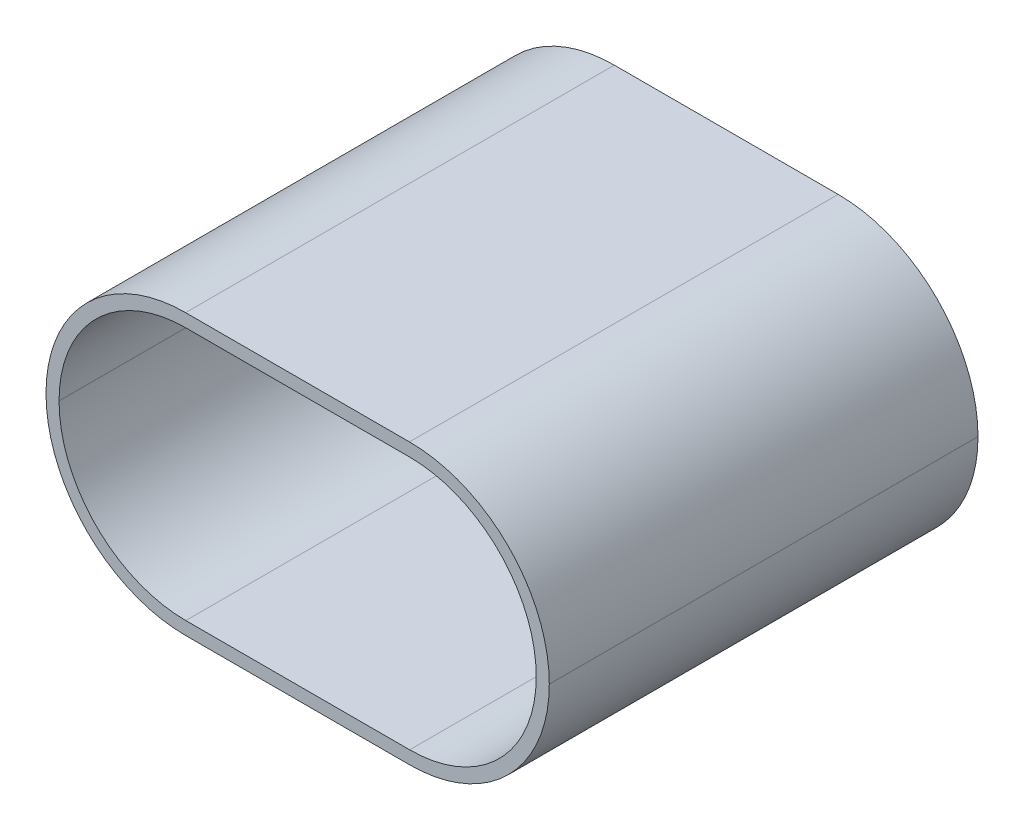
ISO-10303-21;
HEADER;
FILE_DESCRIPTION(('STEP AP214'),'2;1');
FILE_NAME('part.step','',(''),(''),'','','');
FILE_SCHEMA(('AUTOMOTIVE_DESIGN { 1 0 10303 214 1 1 1 1 }'));
ENDSEC;
DATA;
#1=APPLICATION_CONTEXT('core data for automotive mechanical design processes');
#2=APPLICATION_PROTOCOL_DEFINITION('international standard','automotive_design',2000,#1);
#3=PRODUCT_CONTEXT('',#1,'mechanical');
#4=PRODUCT('Part','Part','',(#3));
#5=PRODUCT_RELATED_PRODUCT_CATEGORY('part','',(#4));
#6=PRODUCT_DEFINITION_FORMATION('','',#4);
#7=PRODUCT_DEFINITION_CONTEXT('part definition',#1,'design');
#8=PRODUCT_DEFINITION('design','',#6,#7);
#9=PRODUCT_DEFINITION_SHAPE('','',#8);
#10=(LENGTH_UNIT() NAMED_UNIT(*) SI_UNIT(.MILLI.,.METRE.));
#11=(NAMED_UNIT(*) PLANE_ANGLE_UNIT() SI_UNIT($,.RADIAN.));
#12=(NAMED_UNIT(*) SI_UNIT($,.STERADIAN.) SOLID_ANGLE_UNIT());
#13=UNCERTAINTY_MEASURE_WITH_UNIT(LENGTH_MEASURE(1.E-05),#10,'distance_accuracy_value','');
#14=(GEOMETRIC_REPRESENTATION_CONTEXT(3) GLOBAL_UNCERTAINTY_ASSIGNED_CONTEXT((#13)) GLOBAL_UNIT_ASSIGNED_CONTEXT((#10,
#11,#12)) REPRESENTATION_CONTEXT('',''));
#15=CARTESIAN_POINT('',(0.,0.,0.));
#16=DIRECTION('',(0.,0.,1.));
#17=DIRECTION('',(1.,0.,0.));
#18=AXIS2_PLACEMENT_3D('',#15,#16,#17);
#19=CARTESIAN_POINT('',(3.17090192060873,-14.1,-24.));
#20=DIRECTION('',(0.,0.,1.));
#21=DIRECTION('',(1.,0.,0.));
#22=AXIS2_PLACEMENT_3D('',#19,#20,#21);
#23=CYLINDRICAL_SURFACE('',#22,6.8);
#24=CARTESIAN_POINT('',(3.17090192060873,-14.1,-23.));
#25=DIRECTION('',(0.,0.,-1.));
#26=DIRECTION('',(-1.,0.,0.));
#27=AXIS2_PLACEMENT_3D('',#24,#25,#26);
#28=CIRCLE('',#27,6.8);
#29=CARTESIAN_POINT('',(9.97090192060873,-14.1,-23.));
#30=VERTEX_POINT('',#29);
#31=CARTESIAN_POINT('',(3.17090192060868,-7.3,-23.));
#32=VERTEX_POINT('',#31);
#33=EDGE_CURVE('E47',#30,#32,#28,.F.);
#34=ORIENTED_EDGE('',*,*,#33,.F.);
#35=DIRECTION('',(0.,0.,1.));
#36=VECTOR('',#35,1.);
#37=CARTESIAN_POINT('',(9.97090192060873,-14.1,-24.));
#38=LINE('',#37,#36);
#39=CARTESIAN_POINT('',(9.97090192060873,-14.1,-1.));
#40=VERTEX_POINT('',#39);
#41=EDGE_CURVE('E332',#30,#40,#38,.T.);
#42=ORIENTED_EDGE('',*,*,#41,.T.);
#43=CARTESIAN_POINT('',(3.17090192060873,-14.1,-1.));
#44=DIRECTION('',(0.,0.,1.));
#45=DIRECTION('',(1.,0.,0.));
#46=AXIS2_PLACEMENT_3D('',#43,#44,#45);
#47=CIRCLE('',#46,6.8);
#48=CARTESIAN_POINT('',(3.17090192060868,-7.3,-1.));
#49=VERTEX_POINT('',#48);
#50=EDGE_CURVE('E328',#49,#40,#47,.F.);
#51=ORIENTED_EDGE('',*,*,#50,.F.);
#52=DIRECTION('',(0.,0.,1.));
#53=VECTOR('',#52,1.);
#54=CARTESIAN_POINT('',(3.17090192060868,-7.3,-24.));
#55=LINE('',#54,#53);
#56=EDGE_CURVE('E331',#32,#49,#55,.T.);
#57=ORIENTED_EDGE('',*,*,#56,.F.);
#58=EDGE_LOOP('',(#34,#42,#51,#57));
#59=FACE_BOUND('',#58,.T.);
#60=ADVANCED_FACE('F32',(#59),#23,.F.);
#61=CARTESIAN_POINT('',(9.97090192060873,-14.11,-24.));
#62=DIRECTION('',(1.,-1.73472347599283E-13,0.));
#63=DIRECTION('',(1.73472347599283E-13,1.,0.));
#64=AXIS2_PLACEMENT_3D('',#61,#62,#63);
#65=PLANE('',#64);
#66=DIRECTION('',(1.73472347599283E-13,1.,0.));
#67=VECTOR('',#66,1.);
#68=CARTESIAN_POINT('',(9.97090192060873,-14.11,-23.));
#69=LINE('',#68,#67);
#70=CARTESIAN_POINT('',(9.97090192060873,-14.11,-23.));
#71=VERTEX_POINT('',#70);
#72=EDGE_CURVE('E54',#71,#30,#69,.T.);
#73=ORIENTED_EDGE('',*,*,#72,.F.);
#74=DIRECTION('',(0.,0.,1.));
#75=VECTOR('',#74,1.);
#76=CARTESIAN_POINT('',(9.97090192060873,-14.11,-24.));
#77=LINE('',#76,#75);
#78=CARTESIAN_POINT('',(9.97090192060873,-14.11,-1.));
#79=VERTEX_POINT('',#78);
#80=EDGE_CURVE('E335',#71,#79,#77,.T.);
#81=ORIENTED_EDGE('',*,*,#80,.T.);
#82=DIRECTION('',(-1.73472347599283E-13,-1.,0.));
#83=VECTOR('',#82,1.);
#84=CARTESIAN_POINT('',(9.97090192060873,-14.11,-1.));
#85=LINE('',#84,#83);
#86=EDGE_CURVE('E325',#40,#79,#85,.T.);
#87=ORIENTED_EDGE('',*,*,#86,.F.);
#88=ORIENTED_EDGE('',*,*,#41,.F.);
#89=EDGE_LOOP('',(#73,#81,#87,#88));
#90=FACE_BOUND('',#89,.T.);
#91=ADVANCED_FACE('F394',(#90),#65,.F.);
#92=CARTESIAN_POINT('',(3.18090192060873,-14.11,-24.));
#93=DIRECTION('',(0.,0.,1.));
#94=DIRECTION('',(1.,0.,0.));
#95=AXIS2_PLACEMENT_3D('',#92,#93,#94);
#96=CYLINDRICAL_SURFACE('',#95,6.79);
#97=CARTESIAN_POINT('',(3.18090192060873,-14.11,-23.));
#98=DIRECTION('',(0.,0.,-1.));
#99=DIRECTION('',(-1.,0.,0.));
#100=AXIS2_PLACEMENT_3D('',#97,#98,#99);
#101=CIRCLE('',#100,6.79);
#102=CARTESIAN_POINT('',(3.18090192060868,-20.9,-23.));
#103=VERTEX_POINT('',#102);
#104=EDGE_CURVE('E281',#103,#71,#101,.F.);
#105=ORIENTED_EDGE('',*,*,#104,.F.);
#106=DIRECTION('',(0.,0.,1.));
#107=VECTOR('',#106,1.);
#108=CARTESIAN_POINT('',(3.18090192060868,-20.9,-24.));
#109=LINE('',#108,#107);
#110=CARTESIAN_POINT('',(3.18090192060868,-20.9,-1.));
#111=VERTEX_POINT('',#110);
#112=EDGE_CURVE('E337',#103,#111,#109,.T.);
#113=ORIENTED_EDGE('',*,*,#112,.T.);
#114=CARTESIAN_POINT('',(3.18090192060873,-14.11,-1.));
#115=DIRECTION('',(0.,0.,1.));
#116=DIRECTION('',(1.,0.,0.));
#117=AXIS2_PLACEMENT_3D('',#114,#115,#116);
#118=CIRCLE('',#117,6.79);
#119=EDGE_CURVE('E322',#79,#111,#118,.F.);
#120=ORIENTED_EDGE('',*,*,#119,.F.);
#121=ORIENTED_EDGE('',*,*,#80,.F.);
#122=EDGE_LOOP('',(#105,#113,#120,#121));
#123=FACE_BOUND('',#122,.T.);
#124=ADVANCED_FACE('F397',(#123),#96,.F.);
#125=CARTESIAN_POINT('',(-8.82909807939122,-20.9,-24.));
#126=DIRECTION('',(0.,-1.,0.));
#127=DIRECTION('',(0.,0.,-1.));
#128=AXIS2_PLACEMENT_3D('',#125,#126,#127);
#129=PLANE('',#128);
#130=DIRECTION('',(1.,0.,0.));
#131=VECTOR('',#130,1.);
#132=CARTESIAN_POINT('',(-8.82909807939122,-20.9,-23.));
#133=LINE('',#132,#131);
#134=CARTESIAN_POINT('',(-8.82909807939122,-20.9,-23.));
#135=VERTEX_POINT('',#134);
#136=EDGE_CURVE('E278',#135,#103,#133,.T.);
#137=ORIENTED_EDGE('',*,*,#136,.F.);
#138=DIRECTION('',(0.,0.,1.));
#139=VECTOR('',#138,1.);
#140=CARTESIAN_POINT('',(-8.82909807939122,-20.9,-24.));
#141=LINE('',#140,#139);
#142=CARTESIAN_POINT('',(-8.82909807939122,-20.9,-1.));
#143=VERTEX_POINT('',#142);
#144=EDGE_CURVE('E339',#135,#143,#141,.T.);
#145=ORIENTED_EDGE('',*,*,#144,.T.);
#146=DIRECTION('',(-1.,0.,0.));
#147=VECTOR('',#146,1.);
#148=CARTESIAN_POINT('',(-8.82909807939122,-20.9,-1.));
#149=LINE('',#148,#147);
#150=EDGE_CURVE('E319',#111,#143,#149,.T.);
#151=ORIENTED_EDGE('',*,*,#150,.F.);
#152=ORIENTED_EDGE('',*,*,#112,.F.);
#153=EDGE_LOOP('',(#137,#145,#151,#152));
#154=FACE_BOUND('',#153,.T.);
#155=ADVANCED_FACE('F401',(#154),#129,.F.);
#156=CARTESIAN_POINT('',(-8.82909807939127,-14.1,-24.));
#157=DIRECTION('',(0.,0.,1.));
#158=DIRECTION('',(1.,0.,0.));
#159=AXIS2_PLACEMENT_3D('',#156,#157,#158);
#160=CYLINDRICAL_SURFACE('',#159,6.8);
#161=CARTESIAN_POINT('',(-8.82909807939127,-14.1,-23.));
#162=DIRECTION('',(0.,0.,-1.));
#163=DIRECTION('',(-1.,0.,0.));
#164=AXIS2_PLACEMENT_3D('',#161,#162,#163);
#165=CIRCLE('',#164,6.8);
#166=CARTESIAN_POINT('',(-15.6290980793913,-14.1,-23.));
#167=VERTEX_POINT('',#166);
#168=EDGE_CURVE('E275',#167,#135,#165,.F.);
#169=ORIENTED_EDGE('',*,*,#168,.F.);
#170=DIRECTION('',(0.,0.,1.));
#171=VECTOR('',#170,1.);
#172=CARTESIAN_POINT('',(-15.6290980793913,-14.1,-24.));
#173=LINE('',#172,#171);
#174=CARTESIAN_POINT('',(-15.6290980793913,-14.1,-1.));
#175=VERTEX_POINT('',#174);
#176=EDGE_CURVE('E341',#167,#175,#173,.T.);
#177=ORIENTED_EDGE('',*,*,#176,.T.);
#178=CARTESIAN_POINT('',(-8.82909807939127,-14.1,-1.));
#179=DIRECTION('',(0.,0.,1.));
#180=DIRECTION('',(1.,0.,0.));
#181=AXIS2_PLACEMENT_3D('',#178,#179,#180);
#182=CIRCLE('',#181,6.8);
#183=EDGE_CURVE('E316',#143,#175,#182,.F.);
#184=ORIENTED_EDGE('',*,*,#183,.F.);
#185=ORIENTED_EDGE('',*,*,#144,.F.);
#186=EDGE_LOOP('',(#169,#177,#184,#185));
#187=FACE_BOUND('',#186,.T.);
#188=ADVANCED_FACE('F406',(#187),#160,.F.);
#189=CARTESIAN_POINT('',(-15.6290980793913,-14.09,-24.));
#190=DIRECTION('',(-1.,0.,0.));
#191=DIRECTION('',(0.,0.,1.));
#192=AXIS2_PLACEMENT_3D('',#189,#190,#191);
#193=PLANE('',#192);
#194=DIRECTION('',(0.,-1.,0.));
#195=VECTOR('',#194,1.);
#196=CARTESIAN_POINT('',(-15.6290980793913,-14.09,-23.));
#197=LINE('',#196,#195);
#198=CARTESIAN_POINT('',(-15.6290980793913,-14.09,-23.));
#199=VERTEX_POINT('',#198);
#200=EDGE_CURVE('E272',#199,#167,#197,.T.);
#201=ORIENTED_EDGE('',*,*,#200,.F.);
#202=DIRECTION('',(0.,0.,1.));
#203=VECTOR('',#202,1.);
#204=CARTESIAN_POINT('',(-15.6290980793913,-14.09,-24.));
#205=LINE('',#204,#203);
#206=CARTESIAN_POINT('',(-15.6290980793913,-14.09,-1.));
#207=VERTEX_POINT('',#206);
#208=EDGE_CURVE('E343',#199,#207,#205,.T.);
#209=ORIENTED_EDGE('',*,*,#208,.T.);
#210=DIRECTION('',(0.,1.,0.));
#211=VECTOR('',#210,1.);
#212=CARTESIAN_POINT('',(-15.6290980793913,-14.09,-1.));
#213=LINE('',#212,#211);
#214=EDGE_CURVE('E313',#175,#207,#213,.T.);
#215=ORIENTED_EDGE('',*,*,#214,.F.);
#216=ORIENTED_EDGE('',*,*,#176,.F.);
#217=EDGE_LOOP('',(#201,#209,#215,#216));
#218=FACE_BOUND('',#217,.T.);
#219=ADVANCED_FACE('F409',(#218),#193,.F.);
#220=CARTESIAN_POINT('',(-8.83909807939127,-14.09,-24.));
#221=DIRECTION('',(0.,0.,1.));
#222=DIRECTION('',(1.,0.,0.));
#223=AXIS2_PLACEMENT_3D('',#220,#221,#222);
#224=CYLINDRICAL_SURFACE('',#223,6.79);
#225=CARTESIAN_POINT('',(-8.83909807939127,-14.09,-23.));
#226=DIRECTION('',(0.,0.,-1.));
#227=DIRECTION('',(-1.,0.,0.));
#228=AXIS2_PLACEMENT_3D('',#225,#226,#227);
#229=CIRCLE('',#228,6.79);
#230=CARTESIAN_POINT('',(-8.83909807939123,-7.3,-23.));
#231=VERTEX_POINT('',#230);
#232=EDGE_CURVE('E258',#231,#199,#229,.F.);
#233=ORIENTED_EDGE('',*,*,#232,.F.);
#234=DIRECTION('',(0.,0.,1.));
#235=VECTOR('',#234,1.);
#236=CARTESIAN_POINT('',(-8.83909807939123,-7.3,-24.));
#237=LINE('',#236,#235);
#238=CARTESIAN_POINT('',(-8.83909807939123,-7.3,-1.));
#239=VERTEX_POINT('',#238);
#240=EDGE_CURVE('E345',#231,#239,#237,.T.);
#241=ORIENTED_EDGE('',*,*,#240,.T.);
#242=CARTESIAN_POINT('',(-8.83909807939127,-14.09,-1.));
#243=DIRECTION('',(0.,0.,1.));
#244=DIRECTION('',(1.,0.,0.));
#245=AXIS2_PLACEMENT_3D('',#242,#243,#244);
#246=CIRCLE('',#245,6.79);
#247=EDGE_CURVE('E310',#207,#239,#246,.F.);
#248=ORIENTED_EDGE('',*,*,#247,.F.);
#249=ORIENTED_EDGE('',*,*,#208,.F.);
#250=EDGE_LOOP('',(#233,#241,#248,#249));
#251=FACE_BOUND('',#250,.T.);
#252=ADVANCED_FACE('F413',(#251),#224,.F.);
#253=CARTESIAN_POINT('',(3.17090192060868,-7.3,-24.));
#254=DIRECTION('',(0.,1.,0.));
#255=DIRECTION('',(0.,0.,1.));
#256=AXIS2_PLACEMENT_3D('',#253,#254,#255);
#257=PLANE('',#256);
#258=DIRECTION('',(-1.,0.,0.));
#259=VECTOR('',#258,1.);
#260=CARTESIAN_POINT('',(3.17090192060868,-7.3,-23.));
#261=LINE('',#260,#259);
#262=EDGE_CURVE('E11',#32,#231,#261,.T.);
#263=ORIENTED_EDGE('',*,*,#262,.F.);
#264=ORIENTED_EDGE('',*,*,#56,.T.);
#265=DIRECTION('',(1.,0.,0.));
#266=VECTOR('',#265,1.);
#267=CARTESIAN_POINT('',(3.17090192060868,-7.3,-1.));
#268=LINE('',#267,#266);
#269=EDGE_CURVE('E40',#239,#49,#268,.T.);
#270=ORIENTED_EDGE('',*,*,#269,.F.);
#271=ORIENTED_EDGE('',*,*,#240,.F.);
#272=EDGE_LOOP('',(#263,#264,#270,#271));
#273=FACE_BOUND('',#272,.T.);
#274=ADVANCED_FACE('F414',(#273),#257,.F.);
#275=CARTESIAN_POINT('',(-8.82909807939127,-14.1,-24.));
#276=DIRECTION('',(0.,0.,1.));
#277=DIRECTION('',(1.,0.,0.));
#278=AXIS2_PLACEMENT_3D('',#275,#276,#277);
#279=CYLINDRICAL_SURFACE('',#278,7.5);
#280=DIRECTION('',(0.,0.,1.));
#281=VECTOR('',#280,1.);
#282=CARTESIAN_POINT('',(-8.82909807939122,-21.6,-24.));
#283=LINE('',#282,#281);
#284=CARTESIAN_POINT('',(-8.82909807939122,-21.6,-24.));
#285=VERTEX_POINT('',#284);
#286=CARTESIAN_POINT('',(-8.82909807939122,-21.6,-1.));
#287=VERTEX_POINT('',#286);
#288=EDGE_CURVE('E371',#285,#287,#283,.T.);
#289=ORIENTED_EDGE('',*,*,#288,.T.);
#290=CARTESIAN_POINT('',(-8.82909807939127,-14.1,-1.));
#291=DIRECTION('',(0.,0.,1.));
#292=DIRECTION('',(1.,0.,0.));
#293=AXIS2_PLACEMENT_3D('',#290,#291,#292);
#294=CIRCLE('',#293,7.5);
#295=CARTESIAN_POINT('',(-16.3290980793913,-14.1,-1.));
#296=VERTEX_POINT('',#295);
#297=EDGE_CURVE('E286',#296,#287,#294,.T.);
#298=ORIENTED_EDGE('',*,*,#297,.F.);
#299=DIRECTION('',(0.,0.,1.));
#300=VECTOR('',#299,1.);
#301=CARTESIAN_POINT('',(-16.3290980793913,-14.1,-24.));
#302=LINE('',#301,#300);
#303=CARTESIAN_POINT('',(-16.3290980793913,-14.1,-24.));
#304=VERTEX_POINT('',#303);
#305=EDGE_CURVE('E372',#304,#296,#302,.T.);
#306=ORIENTED_EDGE('',*,*,#305,.F.);
#307=CARTESIAN_POINT('',(-8.82909807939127,-14.1,-24.));
#308=DIRECTION('',(0.,0.,1.));
#309=DIRECTION('',(1.,0.,0.));
#310=AXIS2_PLACEMENT_3D('',#307,#308,#309);
#311=CIRCLE('',#310,7.5);
#312=EDGE_CURVE('E334',#304,#285,#311,.T.);
#313=ORIENTED_EDGE('',*,*,#312,.T.);
#314=EDGE_LOOP('',(#289,#298,#306,#313));
#315=FACE_BOUND('',#314,.T.);
#316=ADVANCED_FACE('F34',(#315),#279,.T.);
#317=CARTESIAN_POINT('',(-16.3290980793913,-14.09,-24.));
#318=DIRECTION('',(-1.,0.,0.));
#319=DIRECTION('',(0.,0.,1.));
#320=AXIS2_PLACEMENT_3D('',#317,#318,#319);
#321=PLANE('',#320);
#322=ORIENTED_EDGE('',*,*,#305,.T.);
#323=DIRECTION('',(0.,-1.,0.));
#324=VECTOR('',#323,1.);
#325=CARTESIAN_POINT('',(-16.3290980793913,-14.09,-1.));
#326=LINE('',#325,#324);
#327=CARTESIAN_POINT('',(-16.3290980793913,-14.09,-1.));
#328=VERTEX_POINT('',#327);
#329=EDGE_CURVE('E307',#328,#296,#326,.T.);
#330=ORIENTED_EDGE('',*,*,#329,.F.);
#331=DIRECTION('',(0.,0.,1.));
#332=VECTOR('',#331,1.);
#333=CARTESIAN_POINT('',(-16.3290980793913,-14.09,-24.));
#334=LINE('',#333,#332);
#335=CARTESIAN_POINT('',(-16.3290980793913,-14.09,-24.));
#336=VERTEX_POINT('',#335);
#337=EDGE_CURVE('E374',#336,#328,#334,.T.);
#338=ORIENTED_EDGE('',*,*,#337,.F.);
#339=DIRECTION('',(0.,-1.,0.));
#340=VECTOR('',#339,1.);
#341=CARTESIAN_POINT('',(-16.3290980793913,-14.09,-24.));
#342=LINE('',#341,#340);
#343=EDGE_CURVE('E368',#336,#304,#342,.T.);
#344=ORIENTED_EDGE('',*,*,#343,.T.);
#345=EDGE_LOOP('',(#322,#330,#338,#344));
#346=FACE_BOUND('',#345,.T.);
#347=ADVANCED_FACE('F421',(#346),#321,.T.);
#348=CARTESIAN_POINT('',(-8.83909807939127,-14.09,-24.));
#349=DIRECTION('',(0.,0.,1.));
#350=DIRECTION('',(1.,0.,0.));
#351=AXIS2_PLACEMENT_3D('',#348,#349,#350);
#352=CYLINDRICAL_SURFACE('',#351,7.49);
#353=ORIENTED_EDGE('',*,*,#337,.T.);
#354=CARTESIAN_POINT('',(-8.83909807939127,-14.09,-1.));
#355=DIRECTION('',(0.,0.,1.));
#356=DIRECTION('',(1.,0.,0.));
#357=AXIS2_PLACEMENT_3D('',#354,#355,#356);
#358=CIRCLE('',#357,7.49);
#359=CARTESIAN_POINT('',(-8.83909807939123,-6.6,-1.));
#360=VERTEX_POINT('',#359);
#361=EDGE_CURVE('E304',#360,#328,#358,.T.);
#362=ORIENTED_EDGE('',*,*,#361,.F.);
#363=DIRECTION('',(0.,0.,1.));
#364=VECTOR('',#363,1.);
#365=CARTESIAN_POINT('',(-8.83909807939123,-6.6,-24.));
#366=LINE('',#365,#364);
#367=CARTESIAN_POINT('',(-8.83909807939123,-6.6,-24.));
#368=VERTEX_POINT('',#367);
#369=EDGE_CURVE('E376',#368,#360,#366,.T.);
#370=ORIENTED_EDGE('',*,*,#369,.F.);
#371=CARTESIAN_POINT('',(-8.83909807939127,-14.09,-24.));
#372=DIRECTION('',(0.,0.,1.));
#373=DIRECTION('',(1.,0.,0.));
#374=AXIS2_PLACEMENT_3D('',#371,#372,#373);
#375=CIRCLE('',#374,7.49);
#376=EDGE_CURVE('E365',#368,#336,#375,.T.);
#377=ORIENTED_EDGE('',*,*,#376,.T.);
#378=EDGE_LOOP('',(#353,#362,#370,#377));
#379=FACE_BOUND('',#378,.T.);
#380=ADVANCED_FACE('F438',(#379),#352,.T.);
#381=CARTESIAN_POINT('',(3.17090192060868,-6.6,-24.));
#382=DIRECTION('',(0.,1.,0.));
#383=DIRECTION('',(0.,0.,1.));
#384=AXIS2_PLACEMENT_3D('',#381,#382,#383);
#385=PLANE('',#384);
#386=ORIENTED_EDGE('',*,*,#369,.T.);
#387=DIRECTION('',(-1.,0.,0.));
#388=VECTOR('',#387,1.);
#389=CARTESIAN_POINT('',(3.17090192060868,-6.6,-1.));
#390=LINE('',#389,#388);
#391=CARTESIAN_POINT('',(3.17090192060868,-6.6,-1.));
#392=VERTEX_POINT('',#391);
#393=EDGE_CURVE('E301',#392,#360,#390,.T.);
#394=ORIENTED_EDGE('',*,*,#393,.F.);
#395=DIRECTION('',(0.,0.,1.));
#396=VECTOR('',#395,1.);
#397=CARTESIAN_POINT('',(3.17090192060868,-6.6,-24.));
#398=LINE('',#397,#396);
#399=CARTESIAN_POINT('',(3.17090192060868,-6.6,-24.));
#400=VERTEX_POINT('',#399);
#401=EDGE_CURVE('E378',#400,#392,#398,.T.);
#402=ORIENTED_EDGE('',*,*,#401,.F.);
#403=DIRECTION('',(-1.,0.,0.));
#404=VECTOR('',#403,1.);
#405=CARTESIAN_POINT('',(3.17090192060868,-6.6,-24.));
#406=LINE('',#405,#404);
#407=EDGE_CURVE('E362',#400,#368,#406,.T.);
#408=ORIENTED_EDGE('',*,*,#407,.T.);
#409=EDGE_LOOP('',(#386,#394,#402,#408));
#410=FACE_BOUND('',#409,.T.);
#411=ADVANCED_FACE('F442',(#410),#385,.T.);
#412=CARTESIAN_POINT('',(3.17090192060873,-14.1,-24.));
#413=DIRECTION('',(0.,0.,1.));
#414=DIRECTION('',(1.,0.,0.));
#415=AXIS2_PLACEMENT_3D('',#412,#413,#414);
#416=CYLINDRICAL_SURFACE('',#415,7.5);
#417=ORIENTED_EDGE('',*,*,#401,.T.);
#418=CARTESIAN_POINT('',(3.17090192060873,-14.1,-1.));
#419=DIRECTION('',(0.,0.,1.));
#420=DIRECTION('',(1.,0.,0.));
#421=AXIS2_PLACEMENT_3D('',#418,#419,#420);
#422=CIRCLE('',#421,7.5);
#423=CARTESIAN_POINT('',(10.6709019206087,-14.1,-1.));
#424=VERTEX_POINT('',#423);
#425=EDGE_CURVE('E298',#424,#392,#422,.T.);
#426=ORIENTED_EDGE('',*,*,#425,.F.);
#427=DIRECTION('',(0.,0.,1.));
#428=VECTOR('',#427,1.);
#429=CARTESIAN_POINT('',(10.6709019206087,-14.1,-24.));
#430=LINE('',#429,#428);
#431=CARTESIAN_POINT('',(10.6709019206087,-14.1,-24.));
#432=VERTEX_POINT('',#431);
#433=EDGE_CURVE('E380',#432,#424,#430,.T.);
#434=ORIENTED_EDGE('',*,*,#433,.F.);
#435=CARTESIAN_POINT('',(3.17090192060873,-14.1,-24.));
#436=DIRECTION('',(0.,0.,1.));
#437=DIRECTION('',(1.,0.,0.));
#438=AXIS2_PLACEMENT_3D('',#435,#436,#437);
#439=CIRCLE('',#438,7.5);
#440=EDGE_CURVE('E359',#432,#400,#439,.T.);
#441=ORIENTED_EDGE('',*,*,#440,.T.);
#442=EDGE_LOOP('',(#417,#426,#434,#441));
#443=FACE_BOUND('',#442,.T.);
#444=ADVANCED_FACE('F446',(#443),#416,.T.);
#445=CARTESIAN_POINT('',(10.6709019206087,-14.1099999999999,-24.));
#446=DIRECTION('',(1.,1.73472347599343E-13,0.));
#447=DIRECTION('',(-1.73472347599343E-13,1.,0.));
#448=AXIS2_PLACEMENT_3D('',#445,#446,#447);
#449=PLANE('',#448);
#450=ORIENTED_EDGE('',*,*,#433,.T.);
#451=DIRECTION('',(-1.73472347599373E-13,1.,0.));
#452=VECTOR('',#451,1.);
#453=CARTESIAN_POINT('',(10.6709019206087,-14.1099999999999,-1.));
#454=LINE('',#453,#452);
#455=CARTESIAN_POINT('',(10.6709019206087,-14.1099999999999,-1.));
#456=VERTEX_POINT('',#455);
#457=EDGE_CURVE('E295',#456,#424,#454,.T.);
#458=ORIENTED_EDGE('',*,*,#457,.F.);
#459=DIRECTION('',(0.,0.,1.));
#460=VECTOR('',#459,1.);
#461=CARTESIAN_POINT('',(10.6709019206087,-14.1099999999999,-24.));
#462=LINE('',#461,#460);
#463=CARTESIAN_POINT('',(10.6709019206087,-14.1099999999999,-24.));
#464=VERTEX_POINT('',#463);
#465=EDGE_CURVE('E382',#464,#456,#462,.T.);
#466=ORIENTED_EDGE('',*,*,#465,.F.);
#467=DIRECTION('',(-1.73472347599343E-13,1.,0.));
#468=VECTOR('',#467,1.);
#469=CARTESIAN_POINT('',(10.6709019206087,-14.1099999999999,-24.));
#470=LINE('',#469,#468);
#471=EDGE_CURVE('E356',#464,#432,#470,.T.);
#472=ORIENTED_EDGE('',*,*,#471,.T.);
#473=EDGE_LOOP('',(#450,#458,#466,#472));
#474=FACE_BOUND('',#473,.T.);
#475=ADVANCED_FACE('F450',(#474),#449,.T.);
#476=CARTESIAN_POINT('',(3.18090192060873,-14.11,-24.));
#477=DIRECTION('',(0.,0.,1.));
#478=DIRECTION('',(1.,0.,0.));
#479=AXIS2_PLACEMENT_3D('',#476,#477,#478);
#480=CYLINDRICAL_SURFACE('',#479,7.49);
#481=ORIENTED_EDGE('',*,*,#465,.T.);
#482=CARTESIAN_POINT('',(3.18090192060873,-14.11,-1.));
#483=DIRECTION('',(0.,0.,1.));
#484=DIRECTION('',(1.,0.,0.));
#485=AXIS2_PLACEMENT_3D('',#482,#483,#484);
#486=CIRCLE('',#485,7.49);
#487=CARTESIAN_POINT('',(3.18090192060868,-21.6,-1.));
#488=VERTEX_POINT('',#487);
#489=EDGE_CURVE('E292',#488,#456,#486,.T.);
#490=ORIENTED_EDGE('',*,*,#489,.F.);
#491=DIRECTION('',(0.,0.,1.));
#492=VECTOR('',#491,1.);
#493=CARTESIAN_POINT('',(3.18090192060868,-21.6,-24.));
#494=LINE('',#493,#492);
#495=CARTESIAN_POINT('',(3.18090192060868,-21.6,-24.));
#496=VERTEX_POINT('',#495);
#497=EDGE_CURVE('E384',#496,#488,#494,.T.);
#498=ORIENTED_EDGE('',*,*,#497,.F.);
#499=CARTESIAN_POINT('',(3.18090192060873,-14.11,-24.));
#500=DIRECTION('',(0.,0.,1.));
#501=DIRECTION('',(1.,0.,0.));
#502=AXIS2_PLACEMENT_3D('',#499,#500,#501);
#503=CIRCLE('',#502,7.49);
#504=EDGE_CURVE('E353',#496,#464,#503,.T.);
#505=ORIENTED_EDGE('',*,*,#504,.T.);
#506=EDGE_LOOP('',(#481,#490,#498,#505));
#507=FACE_BOUND('',#506,.T.);
#508=ADVANCED_FACE('F454',(#507),#480,.T.);
#509=CARTESIAN_POINT('',(-8.82909807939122,-21.6,-24.));
#510=DIRECTION('',(0.,-1.,0.));
#511=DIRECTION('',(0.,0.,-1.));
#512=AXIS2_PLACEMENT_3D('',#509,#510,#511);
#513=PLANE('',#512);
#514=ORIENTED_EDGE('',*,*,#497,.T.);
#515=DIRECTION('',(1.,0.,0.));
#516=VECTOR('',#515,1.);
#517=CARTESIAN_POINT('',(-8.82909807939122,-21.6,-1.));
#518=LINE('',#517,#516);
#519=EDGE_CURVE('E289',#287,#488,#518,.T.);
#520=ORIENTED_EDGE('',*,*,#519,.F.);
#521=ORIENTED_EDGE('',*,*,#288,.F.);
#522=DIRECTION('',(1.,0.,0.));
#523=VECTOR('',#522,1.);
#524=CARTESIAN_POINT('',(-8.82909807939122,-21.6,-24.));
#525=LINE('',#524,#523);
#526=EDGE_CURVE('E350',#285,#496,#525,.T.);
#527=ORIENTED_EDGE('',*,*,#526,.T.);
#528=EDGE_LOOP('',(#514,#520,#521,#527));
#529=FACE_BOUND('',#528,.T.);
#530=ADVANCED_FACE('F434',(#529),#513,.T.);
#531=CARTESIAN_POINT('',(-8.82909807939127,-14.1,-24.));
#532=DIRECTION('',(0.,0.,1.));
#533=DIRECTION('',(1.,0.,0.));
#534=AXIS2_PLACEMENT_3D('',#531,#532,#533);
#535=PLANE('',#534);
#536=ORIENTED_EDGE('',*,*,#312,.F.);
#537=ORIENTED_EDGE('',*,*,#343,.F.);
#538=ORIENTED_EDGE('',*,*,#376,.F.);
#539=ORIENTED_EDGE('',*,*,#407,.F.);
#540=ORIENTED_EDGE('',*,*,#440,.F.);
#541=ORIENTED_EDGE('',*,*,#471,.F.);
#542=ORIENTED_EDGE('',*,*,#504,.F.);
#543=ORIENTED_EDGE('',*,*,#526,.F.);
#544=EDGE_LOOP('',(#536,#537,#538,#539,#540,#541,#542,#543));
#545=FACE_BOUND('',#544,.T.);
#546=CARTESIAN_POINT('',(-8.83909807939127,-14.09,-24.));
#547=DIRECTION('',(0.,0.,-1.));
#548=DIRECTION('',(-1.,0.,0.));
#549=AXIS2_PLACEMENT_3D('',#546,#547,#548);
#550=CIRCLE('',#549,4.99);
#551=CARTESIAN_POINT('',(-13.8290980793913,-14.09,-24.));
#552=VERTEX_POINT('',#551);
#553=CARTESIAN_POINT('',(-8.83909807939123,-9.1,-24.));
#554=VERTEX_POINT('',#553);
#555=EDGE_CURVE('E201',#552,#554,#550,.T.);
#556=ORIENTED_EDGE('',*,*,#555,.F.);
#557=DIRECTION('',(0.,1.,0.));
#558=VECTOR('',#557,1.);
#559=CARTESIAN_POINT('',(-13.8290980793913,-14.1,-24.));
#560=LINE('',#559,#558);
#561=CARTESIAN_POINT('',(-13.8290980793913,-14.1,-24.));
#562=VERTEX_POINT('',#561);
#563=EDGE_CURVE('E220',#562,#552,#560,.T.);
#564=ORIENTED_EDGE('',*,*,#563,.F.);
#565=CARTESIAN_POINT('',(-8.82909807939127,-14.1,-24.));
#566=DIRECTION('',(0.,0.,-1.));
#567=DIRECTION('',(-1.,0.,0.));
#568=AXIS2_PLACEMENT_3D('',#565,#566,#567);
#569=CIRCLE('',#568,5.);
#570=CARTESIAN_POINT('',(-8.82909807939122,-19.1,-24.));
#571=VERTEX_POINT('',#570);
#572=EDGE_CURVE('E223',#571,#562,#569,.T.);
#573=ORIENTED_EDGE('',*,*,#572,.F.);
#574=DIRECTION('',(-1.,0.,0.));
#575=VECTOR('',#574,1.);
#576=CARTESIAN_POINT('',(3.1809019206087,-19.1,-24.));
#577=LINE('',#576,#575);
#578=CARTESIAN_POINT('',(3.1809019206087,-19.1,-24.));
#579=VERTEX_POINT('',#578);
#580=EDGE_CURVE('E251',#579,#571,#577,.T.);
#581=ORIENTED_EDGE('',*,*,#580,.F.);
#582=CARTESIAN_POINT('',(3.18090192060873,-14.11,-24.));
#583=DIRECTION('',(0.,0.,-1.));
#584=DIRECTION('',(-1.,0.,0.));
#585=AXIS2_PLACEMENT_3D('',#582,#583,#584);
#586=CIRCLE('',#585,4.99);
#587=CARTESIAN_POINT('',(8.17090192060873,-14.1099999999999,-24.));
#588=VERTEX_POINT('',#587);
#589=EDGE_CURVE('E248',#588,#579,#586,.T.);
#590=ORIENTED_EDGE('',*,*,#589,.F.);
#591=DIRECTION('',(-1.73472347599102E-13,-1.,0.));
#592=VECTOR('',#591,1.);
#593=CARTESIAN_POINT('',(8.17090192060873,-14.1,-24.));
#594=LINE('',#593,#592);
#595=CARTESIAN_POINT('',(8.17090192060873,-14.1,-24.));
#596=VERTEX_POINT('',#595);
#597=EDGE_CURVE('E245',#596,#588,#594,.T.);
#598=ORIENTED_EDGE('',*,*,#597,.F.);
#599=CARTESIAN_POINT('',(3.17090192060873,-14.1,-24.));
#600=DIRECTION('',(0.,0.,-1.));
#601=DIRECTION('',(-1.,0.,0.));
#602=AXIS2_PLACEMENT_3D('',#599,#600,#601);
#603=CIRCLE('',#602,5.);
#604=CARTESIAN_POINT('',(3.17090192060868,-9.1,-24.));
#605=VERTEX_POINT('',#604);
#606=EDGE_CURVE('E242',#605,#596,#603,.T.);
#607=ORIENTED_EDGE('',*,*,#606,.F.);
#608=DIRECTION('',(1.,0.,0.));
#609=VECTOR('',#608,1.);
#610=CARTESIAN_POINT('',(-8.83909807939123,-9.1,-24.));
#611=LINE('',#610,#609);
#612=EDGE_CURVE('E240',#554,#605,#611,.T.);
#613=ORIENTED_EDGE('',*,*,#612,.F.);
#614=EDGE_LOOP('',(#556,#564,#573,#581,#590,#598,#607,#613));
#615=FACE_BOUND('',#614,.T.);
#616=ADVANCED_FACE('F431',(#545,#615),#535,.F.);
#617=CARTESIAN_POINT('',(-8.82909807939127,-14.1,-1.));
#618=DIRECTION('',(0.,0.,1.));
#619=DIRECTION('',(1.,0.,0.));
#620=AXIS2_PLACEMENT_3D('',#617,#618,#619);
#621=PLANE('',#620);
#622=ORIENTED_EDGE('',*,*,#297,.T.);
#623=ORIENTED_EDGE('',*,*,#519,.T.);
#624=ORIENTED_EDGE('',*,*,#489,.T.);
#625=ORIENTED_EDGE('',*,*,#457,.T.);
#626=ORIENTED_EDGE('',*,*,#425,.T.);
#627=ORIENTED_EDGE('',*,*,#393,.T.);
#628=ORIENTED_EDGE('',*,*,#361,.T.);
#629=ORIENTED_EDGE('',*,*,#329,.T.);
#630=EDGE_LOOP('',(#622,#623,#624,#625,#626,#627,#628,#629));
#631=FACE_BOUND('',#630,.T.);
#632=ORIENTED_EDGE('',*,*,#50,.T.);
#633=ORIENTED_EDGE('',*,*,#86,.T.);
#634=ORIENTED_EDGE('',*,*,#119,.T.);
#635=ORIENTED_EDGE('',*,*,#150,.T.);
#636=ORIENTED_EDGE('',*,*,#183,.T.);
#637=ORIENTED_EDGE('',*,*,#214,.T.);
#638=ORIENTED_EDGE('',*,*,#247,.T.);
#639=ORIENTED_EDGE('',*,*,#269,.T.);
#640=EDGE_LOOP('',(#632,#633,#634,#635,#636,#637,#638,#639));
#641=FACE_BOUND('',#640,.T.);
#642=ADVANCED_FACE('F390',(#631,#641),#621,.T.);
#643=CARTESIAN_POINT('',(-8.82909807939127,-14.1,-23.));
#644=DIRECTION('',(0.,0.,-1.));
#645=DIRECTION('',(-1.,0.,0.));
#646=AXIS2_PLACEMENT_3D('',#643,#644,#645);
#647=PLANE('',#646);
#648=DIRECTION('',(0.,1.,0.));
#649=VECTOR('',#648,1.);
#650=CARTESIAN_POINT('',(-13.8290980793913,-14.1,-23.));
#651=LINE('',#650,#649);
#652=CARTESIAN_POINT('',(-13.8290980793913,-14.1,-23.));
#653=VERTEX_POINT('',#652);
#654=CARTESIAN_POINT('',(-13.8290980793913,-14.09,-23.));
#655=VERTEX_POINT('',#654);
#656=EDGE_CURVE('E206',#653,#655,#651,.T.);
#657=ORIENTED_EDGE('',*,*,#656,.T.);
#658=CARTESIAN_POINT('',(-8.83909807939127,-14.09,-23.));
#659=DIRECTION('',(0.,0.,-1.));
#660=DIRECTION('',(-1.,0.,0.));
#661=AXIS2_PLACEMENT_3D('',#658,#659,#660);
#662=CIRCLE('',#661,4.99);
#663=CARTESIAN_POINT('',(-8.83909807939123,-9.1,-23.));
#664=VERTEX_POINT('',#663);
#665=EDGE_CURVE('E198',#655,#664,#662,.T.);
#666=ORIENTED_EDGE('',*,*,#665,.T.);
#667=DIRECTION('',(1.,0.,0.));
#668=VECTOR('',#667,1.);
#669=CARTESIAN_POINT('',(-8.83909807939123,-9.1,-23.));
#670=LINE('',#669,#668);
#671=CARTESIAN_POINT('',(3.17090192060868,-9.1,-23.));
#672=VERTEX_POINT('',#671);
#673=EDGE_CURVE('E210',#664,#672,#670,.T.);
#674=ORIENTED_EDGE('',*,*,#673,.T.);
#675=CARTESIAN_POINT('',(3.17090192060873,-14.1,-23.));
#676=DIRECTION('',(0.,0.,-1.));
#677=DIRECTION('',(-1.,0.,0.));
#678=AXIS2_PLACEMENT_3D('',#675,#676,#677);
#679=CIRCLE('',#678,5.);
#680=CARTESIAN_POINT('',(8.17090192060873,-14.1,-23.));
#681=VERTEX_POINT('',#680);
#682=EDGE_CURVE('E214',#672,#681,#679,.T.);
#683=ORIENTED_EDGE('',*,*,#682,.T.);
#684=DIRECTION('',(-1.73472347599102E-13,-1.,0.));
#685=VECTOR('',#684,1.);
#686=CARTESIAN_POINT('',(8.17090192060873,-14.1,-23.));
#687=LINE('',#686,#685);
#688=CARTESIAN_POINT('',(8.17090192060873,-14.1099999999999,-23.));
#689=VERTEX_POINT('',#688);
#690=EDGE_CURVE('E227',#681,#689,#687,.T.);
#691=ORIENTED_EDGE('',*,*,#690,.T.);
#692=CARTESIAN_POINT('',(3.18090192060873,-14.11,-23.));
#693=DIRECTION('',(0.,0.,-1.));
#694=DIRECTION('',(-1.,0.,0.));
#695=AXIS2_PLACEMENT_3D('',#692,#693,#694);
#696=CIRCLE('',#695,4.99);
#697=CARTESIAN_POINT('',(3.1809019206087,-19.1,-23.));
#698=VERTEX_POINT('',#697);
#699=EDGE_CURVE('E230',#689,#698,#696,.T.);
#700=ORIENTED_EDGE('',*,*,#699,.T.);
#701=DIRECTION('',(-1.,0.,0.));
#702=VECTOR('',#701,1.);
#703=CARTESIAN_POINT('',(3.1809019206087,-19.1,-23.));
#704=LINE('',#703,#702);
#705=CARTESIAN_POINT('',(-8.82909807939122,-19.1,-23.));
#706=VERTEX_POINT('',#705);
#707=EDGE_CURVE('E233',#698,#706,#704,.T.);
#708=ORIENTED_EDGE('',*,*,#707,.T.);
#709=CARTESIAN_POINT('',(-8.82909807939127,-14.1,-23.));
#710=DIRECTION('',(0.,0.,-1.));
#711=DIRECTION('',(-1.,0.,0.));
#712=AXIS2_PLACEMENT_3D('',#709,#710,#711);
#713=CIRCLE('',#712,5.);
#714=EDGE_CURVE('E236',#706,#653,#713,.T.);
#715=ORIENTED_EDGE('',*,*,#714,.T.);
#716=EDGE_LOOP('',(#657,#666,#674,#683,#691,#700,#708,#715));
#717=FACE_BOUND('',#716,.T.);
#718=ORIENTED_EDGE('',*,*,#72,.T.);
#719=ORIENTED_EDGE('',*,*,#33,.T.);
#720=ORIENTED_EDGE('',*,*,#262,.T.);
#721=ORIENTED_EDGE('',*,*,#232,.T.);
#722=ORIENTED_EDGE('',*,*,#200,.T.);
#723=ORIENTED_EDGE('',*,*,#168,.T.);
#724=ORIENTED_EDGE('',*,*,#136,.T.);
#725=ORIENTED_EDGE('',*,*,#104,.T.);
#726=EDGE_LOOP('',(#718,#719,#720,#721,#722,#723,#724,#725));
#727=FACE_BOUND('',#726,.T.);
#728=ADVANCED_FACE('F216',(#717,#727),#647,.F.);
#729=CARTESIAN_POINT('',(-8.83909807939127,-14.09,-23.));
#730=DIRECTION('',(0.,0.,-1.));
#731=DIRECTION('',(-1.,0.,0.));
#732=AXIS2_PLACEMENT_3D('',#729,#730,#731);
#733=CYLINDRICAL_SURFACE('',#732,4.99);
#734=ORIENTED_EDGE('',*,*,#555,.T.);
#735=DIRECTION('',(0.,0.,-1.));
#736=VECTOR('',#735,1.);
#737=CARTESIAN_POINT('',(-8.83909807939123,-9.1,-23.));
#738=LINE('',#737,#736);
#739=EDGE_CURVE('E194',#664,#554,#738,.T.);
#740=ORIENTED_EDGE('',*,*,#739,.F.);
#741=ORIENTED_EDGE('',*,*,#665,.F.);
#742=DIRECTION('',(0.,0.,-1.));
#743=VECTOR('',#742,1.);
#744=CARTESIAN_POINT('',(-13.8290980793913,-14.09,-23.));
#745=LINE('',#744,#743);
#746=EDGE_CURVE('E256',#655,#552,#745,.T.);
#747=ORIENTED_EDGE('',*,*,#746,.T.);
#748=EDGE_LOOP('',(#734,#740,#741,#747));
#749=FACE_BOUND('',#748,.T.);
#750=ADVANCED_FACE('F196',(#749),#733,.F.);
#751=CARTESIAN_POINT('',(-13.8290980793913,-14.1,-23.));
#752=DIRECTION('',(-1.,0.,0.));
#753=DIRECTION('',(0.,0.,1.));
#754=AXIS2_PLACEMENT_3D('',#751,#752,#753);
#755=PLANE('',#754);
#756=ORIENTED_EDGE('',*,*,#563,.T.);
#757=ORIENTED_EDGE('',*,*,#746,.F.);
#758=ORIENTED_EDGE('',*,*,#656,.F.);
#759=DIRECTION('',(0.,0.,-1.));
#760=VECTOR('',#759,1.);
#761=CARTESIAN_POINT('',(-13.8290980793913,-14.1,-23.));
#762=LINE('',#761,#760);
#763=EDGE_CURVE('E259',#653,#562,#762,.T.);
#764=ORIENTED_EDGE('',*,*,#763,.T.);
#765=EDGE_LOOP('',(#756,#757,#758,#764));
#766=FACE_BOUND('',#765,.T.);
#767=ADVANCED_FACE('F501',(#766),#755,.F.);
#768=CARTESIAN_POINT('',(-8.82909807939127,-14.1,-23.));
#769=DIRECTION('',(0.,0.,-1.));
#770=DIRECTION('',(-1.,0.,0.));
#771=AXIS2_PLACEMENT_3D('',#768,#769,#770);
#772=CYLINDRICAL_SURFACE('',#771,5.);
#773=ORIENTED_EDGE('',*,*,#572,.T.);
#774=ORIENTED_EDGE('',*,*,#763,.F.);
#775=ORIENTED_EDGE('',*,*,#714,.F.);
#776=DIRECTION('',(0.,0.,-1.));
#777=VECTOR('',#776,1.);
#778=CARTESIAN_POINT('',(-8.82909807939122,-19.1,-23.));
#779=LINE('',#778,#777);
#780=EDGE_CURVE('E261',#706,#571,#779,.T.);
#781=ORIENTED_EDGE('',*,*,#780,.T.);
#782=EDGE_LOOP('',(#773,#774,#775,#781));
#783=FACE_BOUND('',#782,.T.);
#784=ADVANCED_FACE('F499',(#783),#772,.F.);
#785=CARTESIAN_POINT('',(3.1809019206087,-19.1,-23.));
#786=DIRECTION('',(0.,-1.,0.));
#787=DIRECTION('',(1.,0.,0.));
#788=AXIS2_PLACEMENT_3D('',#785,#786,#787);
#789=PLANE('',#788);
#790=ORIENTED_EDGE('',*,*,#580,.T.);
#791=ORIENTED_EDGE('',*,*,#780,.F.);
#792=ORIENTED_EDGE('',*,*,#707,.F.);
#793=DIRECTION('',(0.,0.,-1.));
#794=VECTOR('',#793,1.);
#795=CARTESIAN_POINT('',(3.1809019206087,-19.1,-23.));
#796=LINE('',#795,#794);
#797=EDGE_CURVE('E263',#698,#579,#796,.T.);
#798=ORIENTED_EDGE('',*,*,#797,.T.);
#799=EDGE_LOOP('',(#790,#791,#792,#798));
#800=FACE_BOUND('',#799,.T.);
#801=ADVANCED_FACE('F496',(#800),#789,.F.);
#802=CARTESIAN_POINT('',(3.18090192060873,-14.11,-23.));
#803=DIRECTION('',(0.,0.,-1.));
#804=DIRECTION('',(-1.,0.,0.));
#805=AXIS2_PLACEMENT_3D('',#802,#803,#804);
#806=CYLINDRICAL_SURFACE('',#805,4.99);
#807=ORIENTED_EDGE('',*,*,#589,.T.);
#808=ORIENTED_EDGE('',*,*,#797,.F.);
#809=ORIENTED_EDGE('',*,*,#699,.F.);
#810=DIRECTION('',(0.,0.,-1.));
#811=VECTOR('',#810,1.);
#812=CARTESIAN_POINT('',(8.17090192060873,-14.1099999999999,-23.));
#813=LINE('',#812,#811);
#814=EDGE_CURVE('E265',#689,#588,#813,.T.);
#815=ORIENTED_EDGE('',*,*,#814,.T.);
#816=EDGE_LOOP('',(#807,#808,#809,#815));
#817=FACE_BOUND('',#816,.T.);
#818=ADVANCED_FACE('F492',(#817),#806,.F.);
#819=CARTESIAN_POINT('',(8.17090192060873,-14.1,-23.));
#820=DIRECTION('',(1.,-1.73472347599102E-13,0.));
#821=DIRECTION('',(1.73472347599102E-13,1.,0.));
#822=AXIS2_PLACEMENT_3D('',#819,#820,#821);
#823=PLANE('',#822);
#824=ORIENTED_EDGE('',*,*,#597,.T.);
#825=ORIENTED_EDGE('',*,*,#814,.F.);
#826=ORIENTED_EDGE('',*,*,#690,.F.);
#827=DIRECTION('',(0.,0.,-1.));
#828=VECTOR('',#827,1.);
#829=CARTESIAN_POINT('',(8.17090192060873,-14.1,-23.));
#830=LINE('',#829,#828);
#831=EDGE_CURVE('E267',#681,#596,#830,.T.);
#832=ORIENTED_EDGE('',*,*,#831,.T.);
#833=EDGE_LOOP('',(#824,#825,#826,#832));
#834=FACE_BOUND('',#833,.T.);
#835=ADVANCED_FACE('F490',(#834),#823,.F.);
#836=CARTESIAN_POINT('',(3.17090192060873,-14.1,-23.));
#837=DIRECTION('',(0.,0.,-1.));
#838=DIRECTION('',(-1.,0.,0.));
#839=AXIS2_PLACEMENT_3D('',#836,#837,#838);
#840=CYLINDRICAL_SURFACE('',#839,5.);
#841=ORIENTED_EDGE('',*,*,#606,.T.);
#842=ORIENTED_EDGE('',*,*,#831,.F.);
#843=ORIENTED_EDGE('',*,*,#682,.F.);
#844=DIRECTION('',(0.,0.,-1.));
#845=VECTOR('',#844,1.);
#846=CARTESIAN_POINT('',(3.17090192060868,-9.1,-23.));
#847=LINE('',#846,#845);
#848=EDGE_CURVE('E205',#672,#605,#847,.T.);
#849=ORIENTED_EDGE('',*,*,#848,.T.);
#850=EDGE_LOOP('',(#841,#842,#843,#849));
#851=FACE_BOUND('',#850,.T.);
#852=ADVANCED_FACE('F486',(#851),#840,.F.);
#853=CARTESIAN_POINT('',(-8.83909807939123,-9.1,-23.));
#854=DIRECTION('',(0.,1.,0.));
#855=DIRECTION('',(0.,0.,1.));
#856=AXIS2_PLACEMENT_3D('',#853,#854,#855);
#857=PLANE('',#856);
#858=ORIENTED_EDGE('',*,*,#612,.T.);
#859=ORIENTED_EDGE('',*,*,#848,.F.);
#860=ORIENTED_EDGE('',*,*,#673,.F.);
#861=ORIENTED_EDGE('',*,*,#739,.T.);
#862=EDGE_LOOP('',(#858,#859,#860,#861));
#863=FACE_BOUND('',#862,.T.);
#864=ADVANCED_FACE('F211',(#863),#857,.F.);
#865=CLOSED_SHELL('',(#60,#91,#124,#155,#188,#219,#252,#274,#316,#347,#380,#411,#444,#475,#508,
#530,#616,#642,#728,#750,#767,#784,#801,#818,#835,#852,#864));
#866=MANIFOLD_SOLID_BREP('B2',#865);
#867=ADVANCED_BREP_SHAPE_REPRESENTATION('',(#18,#866),#14);
#868=SHAPE_DEFINITION_REPRESENTATION(#9,#867);
ENDSEC;
END-ISO-10303-21;
